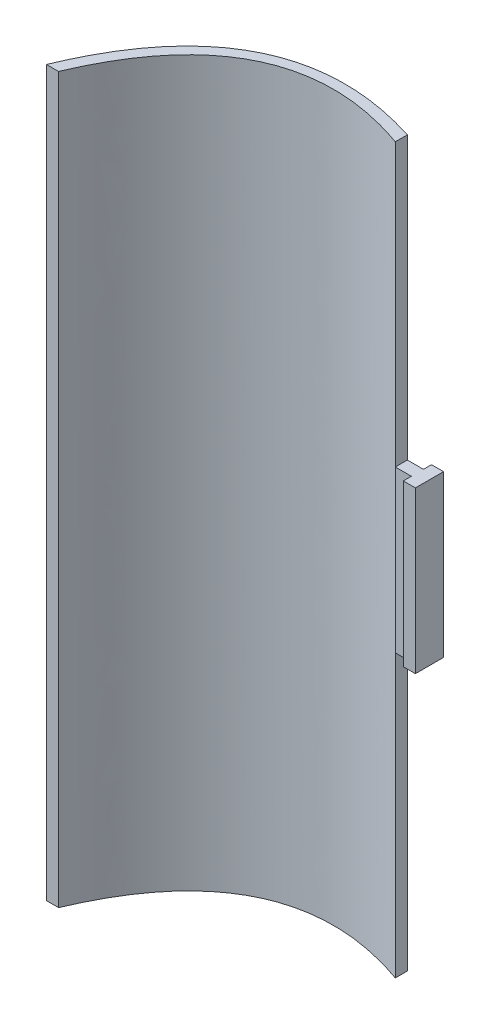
from build123d import *

# Parameters (mm, degrees)
JOINTS_2_DEPTH = 20


with BuildPart() as part:
    # Sketch20 → BodyOfTheBlade section 0
    with BuildSketch(Plane(origin=(0, 180, 0), x_dir=(1, 0, 0), z_dir=(0, 1, 0))):
        with BuildLine():
            Line((0, 21.396366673), (0, 18.396366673))
            add(Edge.make_bspline(
                [(0, 18.396366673), (-39.765588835, 32.557423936), (-57, -8.307519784)],
                knots=[0, 0, 0, 1, 1, 1], degree=2))
            Line((-57, -8.307519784), (-60, -8.307519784))
            add(Edge.make_bspline(
                [(0, 21.396366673), (-42.195600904, 34.883026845), (-60, -8.307519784)],
                knots=[0, 0, 0, 1, 1, 1], degree=2))
        make_face()
    # Sketch10 → BodyOfTheBlade section 1
    with BuildSketch(Plane(origin=(0, 0, 0), x_dir=(1, 0, 0), z_dir=(0, 1, 0))):
        with BuildLine():
            Line((0, 21.396366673), (0, 18.396366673))
            add(Edge.make_bspline(
                [(0, 18.396366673), (-39.765588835, 32.557423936), (-57, -8.307519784)],
                knots=[0, 0, 0, 1, 1, 1], degree=2))
            Line((-57, -8.307519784), (-60, -8.307519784))
            add(Edge.make_bspline(
                [(0, 21.396366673), (-42.195600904, 34.883026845), (-60, -8.307519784)],
                knots=[0, 0, 0, 1, 1, 1], degree=2))
        make_face()
    loft()

    # Sketch22 → Joints 2 (add, symmetric)
    with BuildSketch(Plane(origin=(0, 90, 0), x_dir=(1, 0, 0), z_dir=(0, 1, 0))):
        Polygon((4, 18.396366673), (4, 16.396366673), (7, 16.396366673), (7, 23.396366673), (4, 23.396366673), (4, 21.396366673), (0, 21.396366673), (0, 18.396366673), align=None)
    extrude(amount=JOINTS_2_DEPTH, both=True)


solid = part.part
